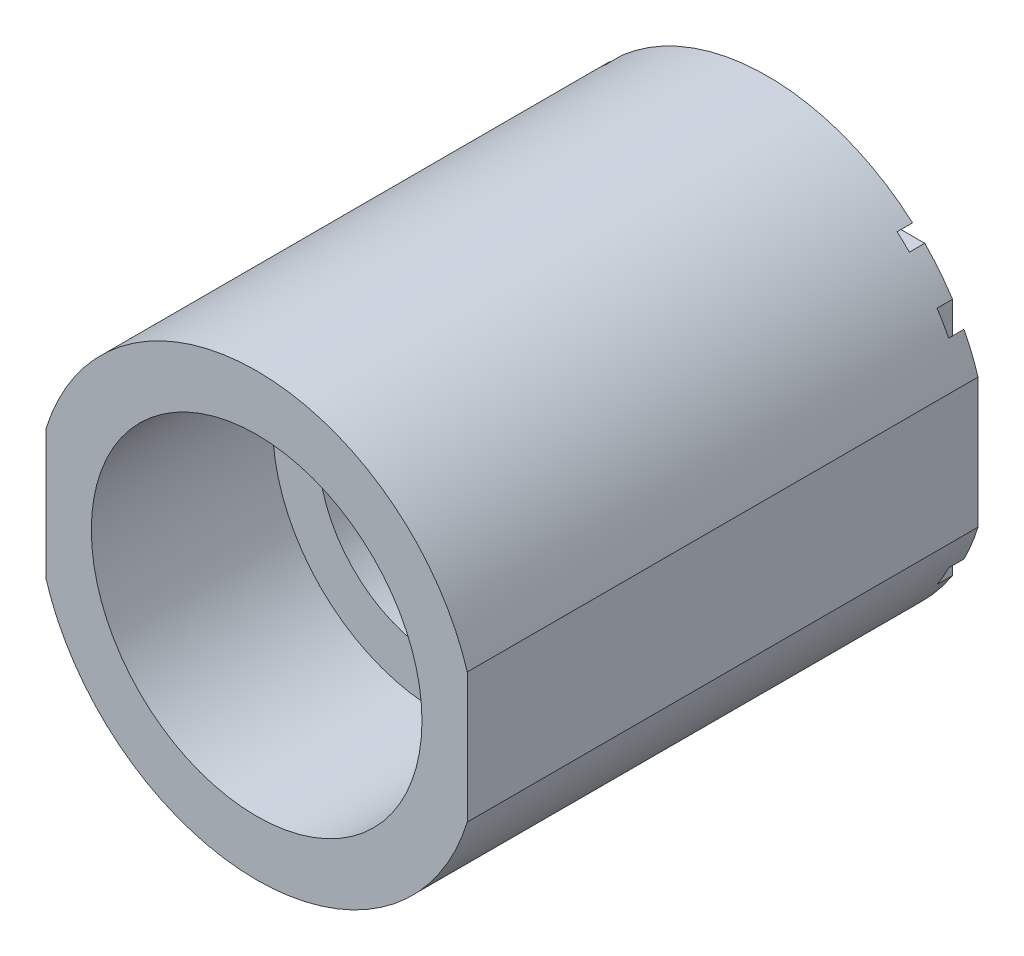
ISO-10303-21;
HEADER;
FILE_DESCRIPTION(('STEP AP214'),'2;1');
FILE_NAME('part.step','',(''),(''),'','','');
FILE_SCHEMA(('AUTOMOTIVE_DESIGN { 1 0 10303 214 1 1 1 1 }'));
ENDSEC;
DATA;
#1=APPLICATION_CONTEXT('core data for automotive mechanical design processes');
#2=APPLICATION_PROTOCOL_DEFINITION('international standard','automotive_design',2000,#1);
#3=PRODUCT_CONTEXT('',#1,'mechanical');
#4=PRODUCT('Part','Part','',(#3));
#5=PRODUCT_RELATED_PRODUCT_CATEGORY('part','',(#4));
#6=PRODUCT_DEFINITION_FORMATION('','',#4);
#7=PRODUCT_DEFINITION_CONTEXT('part definition',#1,'design');
#8=PRODUCT_DEFINITION('design','',#6,#7);
#9=PRODUCT_DEFINITION_SHAPE('','',#8);
#10=(LENGTH_UNIT() NAMED_UNIT(*) SI_UNIT(.MILLI.,.METRE.));
#11=(NAMED_UNIT(*) PLANE_ANGLE_UNIT() SI_UNIT($,.RADIAN.));
#12=(NAMED_UNIT(*) SI_UNIT($,.STERADIAN.) SOLID_ANGLE_UNIT());
#13=UNCERTAINTY_MEASURE_WITH_UNIT(LENGTH_MEASURE(1.E-05),#10,'distance_accuracy_value','');
#14=(GEOMETRIC_REPRESENTATION_CONTEXT(3) GLOBAL_UNCERTAINTY_ASSIGNED_CONTEXT((#13)) GLOBAL_UNIT_ASSIGNED_CONTEXT((#10,
#11,#12)) REPRESENTATION_CONTEXT('',''));
#15=CARTESIAN_POINT('',(0.,0.,0.));
#16=DIRECTION('',(0.,0.,1.));
#17=DIRECTION('',(1.,0.,0.));
#18=AXIS2_PLACEMENT_3D('',#15,#16,#17);
#19=CARTESIAN_POINT('',(0.,0.,0.8));
#20=DIRECTION('',(0.,0.,-1.));
#21=DIRECTION('',(-1.,0.,0.));
#22=AXIS2_PLACEMENT_3D('',#19,#20,#21);
#23=PLANE('',#22);
#24=CARTESIAN_POINT('',(0.,22.475,0.8));
#25=DIRECTION('',(0.,0.,-1.));
#26=DIRECTION('',(-1.,0.,0.));
#27=AXIS2_PLACEMENT_3D('',#24,#25,#26);
#28=CIRCLE('',#27,0.755649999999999);
#29=CARTESIAN_POINT('',(-0.755650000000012,22.475,0.8));
#30=VERTEX_POINT('',#29);
#31=EDGE_CURVE('E161',#30,#30,#28,.T.);
#32=ORIENTED_EDGE('',*,*,#31,.F.);
#33=EDGE_LOOP('',(#32));
#34=FACE_BOUND('',#33,.T.);
#35=DIRECTION('',(1.,0.,0.));
#36=VECTOR('',#35,1.);
#37=CARTESIAN_POINT('',(0.,21.5,0.8));
#38=LINE('',#37,#36);
#39=CARTESIAN_POINT('',(-18.8223437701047,21.5,0.8));
#40=VERTEX_POINT('',#39);
#41=CARTESIAN_POINT('',(18.8223437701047,21.5,0.8));
#42=VERTEX_POINT('',#41);
#43=EDGE_CURVE('E293',#40,#42,#38,.T.);
#44=ORIENTED_EDGE('',*,*,#43,.F.);
#45=CARTESIAN_POINT('',(0.,0.,0.799999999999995));
#46=DIRECTION('',(0.,0.,-1.));
#47=DIRECTION('',(-1.,0.,0.));
#48=AXIS2_PLACEMENT_3D('',#45,#46,#47);
#49=CIRCLE('',#48,28.575);
#50=EDGE_CURVE('E307',#40,#42,#49,.T.);
#51=ORIENTED_EDGE('',*,*,#50,.T.);
#52=EDGE_LOOP('',(#44,#51));
#53=FACE_BOUND('',#52,.T.);
#54=ADVANCED_FACE('F35',(#34,#53),#23,.T.);
#55=DIRECTION('',(0.,1.,0.));
#56=VECTOR('',#55,1.);
#57=CARTESIAN_POINT('',(-25.5,0.,0.8));
#58=LINE('',#57,#56);
#59=CARTESIAN_POINT('',(-25.5,-12.8949844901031,0.8));
#60=VERTEX_POINT('',#59);
#61=CARTESIAN_POINT('',(-25.5,12.8949844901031,0.8));
#62=VERTEX_POINT('',#61);
#63=EDGE_CURVE('E288',#60,#62,#58,.T.);
#64=ORIENTED_EDGE('',*,*,#63,.F.);
#65=CARTESIAN_POINT('',(0.,0.,0.799999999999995));
#66=DIRECTION('',(0.,0.,-1.));
#67=DIRECTION('',(-1.,0.,0.));
#68=AXIS2_PLACEMENT_3D('',#65,#66,#67);
#69=CIRCLE('',#68,28.575);
#70=CARTESIAN_POINT('',(-27.305,-8.42422696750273,0.799999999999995));
#71=VERTEX_POINT('',#70);
#72=EDGE_CURVE('E219',#60,#71,#69,.T.);
#73=ORIENTED_EDGE('',*,*,#72,.T.);
#74=DIRECTION('',(0.,1.,0.));
#75=VECTOR('',#74,1.);
#76=CARTESIAN_POINT('',(-27.305,8.42422696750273,0.8));
#77=LINE('',#76,#75);
#78=CARTESIAN_POINT('',(-27.305,8.42422696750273,0.799999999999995));
#79=VERTEX_POINT('',#78);
#80=EDGE_CURVE('E228',#71,#79,#77,.T.);
#81=ORIENTED_EDGE('',*,*,#80,.T.);
#82=EDGE_CURVE('E225',#79,#62,#49,.T.);
#83=ORIENTED_EDGE('',*,*,#82,.T.);
#84=EDGE_LOOP('',(#64,#73,#81,#83));
#85=FACE_BOUND('',#84,.T.);
#86=ADVANCED_FACE('F322',(#85),#23,.T.);
#87=DIRECTION('',(0.,-1.,0.));
#88=VECTOR('',#87,1.);
#89=CARTESIAN_POINT('',(25.5,0.,0.8));
#90=LINE('',#89,#88);
#91=CARTESIAN_POINT('',(25.5,12.8949844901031,0.8));
#92=VERTEX_POINT('',#91);
#93=CARTESIAN_POINT('',(25.5,-12.8949844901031,0.8));
#94=VERTEX_POINT('',#93);
#95=EDGE_CURVE('E282',#92,#94,#90,.T.);
#96=ORIENTED_EDGE('',*,*,#95,.F.);
#97=CARTESIAN_POINT('',(27.305,8.42422696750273,0.8));
#98=VERTEX_POINT('',#97);
#99=EDGE_CURVE('E223',#92,#98,#49,.T.);
#100=ORIENTED_EDGE('',*,*,#99,.T.);
#101=DIRECTION('',(0.,-1.,0.));
#102=VECTOR('',#101,1.);
#103=CARTESIAN_POINT('',(27.305,8.42422696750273,0.8));
#104=LINE('',#103,#102);
#105=CARTESIAN_POINT('',(27.305,-8.42422696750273,0.8));
#106=VERTEX_POINT('',#105);
#107=EDGE_CURVE('E273',#98,#106,#104,.T.);
#108=ORIENTED_EDGE('',*,*,#107,.T.);
#109=EDGE_CURVE('E220',#106,#94,#69,.T.);
#110=ORIENTED_EDGE('',*,*,#109,.T.);
#111=EDGE_LOOP('',(#96,#100,#108,#110));
#112=FACE_BOUND('',#111,.T.);
#113=ADVANCED_FACE('F330',(#112),#23,.T.);
#114=CARTESIAN_POINT('',(0.,0.,67.));
#115=DIRECTION('',(0.,0.,-1.));
#116=DIRECTION('',(-1.,0.,0.));
#117=AXIS2_PLACEMENT_3D('',#114,#115,#116);
#118=CYLINDRICAL_SURFACE('',#117,28.575);
#119=ORIENTED_EDGE('',*,*,#50,.F.);
#120=DIRECTION('',(0.,0.,-1.));
#121=VECTOR('',#120,1.);
#122=CARTESIAN_POINT('',(-18.8223437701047,21.5,67.));
#123=LINE('',#122,#121);
#124=CARTESIAN_POINT('',(-18.8223437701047,21.5,2.8));
#125=VERTEX_POINT('',#124);
#126=EDGE_CURVE('E175',#40,#125,#123,.F.);
#127=ORIENTED_EDGE('',*,*,#126,.T.);
#128=CARTESIAN_POINT('',(0.,0.,2.8));
#129=DIRECTION('',(0.,0.,-1.));
#130=DIRECTION('',(-1.,0.,0.));
#131=AXIS2_PLACEMENT_3D('',#128,#129,#130);
#132=CIRCLE('',#131,28.575);
#133=CARTESIAN_POINT('',(-20.4090819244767,20.,2.8));
#134=VERTEX_POINT('',#133);
#135=EDGE_CURVE('E11',#134,#125,#132,.T.);
#136=ORIENTED_EDGE('',*,*,#135,.F.);
#137=DIRECTION('',(0.,0.,-1.));
#138=VECTOR('',#137,1.);
#139=CARTESIAN_POINT('',(-20.4090819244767,20.,67.));
#140=LINE('',#139,#138);
#141=CARTESIAN_POINT('',(-20.4090819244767,20.,0.8));
#142=VERTEX_POINT('',#141);
#143=EDGE_CURVE('E172',#134,#142,#140,.T.);
#144=ORIENTED_EDGE('',*,*,#143,.T.);
#145=CARTESIAN_POINT('',(-24.,15.5090497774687,0.799999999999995));
#146=VERTEX_POINT('',#145);
#147=EDGE_CURVE('E229',#146,#142,#49,.T.);
#148=ORIENTED_EDGE('',*,*,#147,.F.);
#149=DIRECTION('',(0.,0.,-1.));
#150=VECTOR('',#149,1.);
#151=CARTESIAN_POINT('',(-24.,15.5090497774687,67.));
#152=LINE('',#151,#150);
#153=CARTESIAN_POINT('',(-24.,15.5090497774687,2.8));
#154=VERTEX_POINT('',#153);
#155=EDGE_CURVE('E58',#146,#154,#152,.F.);
#156=ORIENTED_EDGE('',*,*,#155,.T.);
#157=CARTESIAN_POINT('',(0.,0.,2.8));
#158=DIRECTION('',(0.,0.,-1.));
#159=DIRECTION('',(-1.,0.,0.));
#160=AXIS2_PLACEMENT_3D('',#157,#158,#159);
#161=CIRCLE('',#160,28.575);
#162=CARTESIAN_POINT('',(-25.5,12.8949844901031,2.8));
#163=VERTEX_POINT('',#162);
#164=EDGE_CURVE('E197',#163,#154,#161,.T.);
#165=ORIENTED_EDGE('',*,*,#164,.F.);
#166=DIRECTION('',(0.,0.,-1.));
#167=VECTOR('',#166,1.);
#168=CARTESIAN_POINT('',(-25.5,12.8949844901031,67.));
#169=LINE('',#168,#167);
#170=EDGE_CURVE('E194',#163,#62,#169,.T.);
#171=ORIENTED_EDGE('',*,*,#170,.T.);
#172=ORIENTED_EDGE('',*,*,#82,.F.);
#173=DIRECTION('',(0.,0.,1.));
#174=VECTOR('',#173,1.);
#175=CARTESIAN_POINT('',(-27.305,8.42422696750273,0.));
#176=LINE('',#175,#174);
#177=CARTESIAN_POINT('',(-27.305,8.42422696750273,67.));
#178=VERTEX_POINT('',#177);
#179=EDGE_CURVE('E246',#79,#178,#176,.T.);
#180=ORIENTED_EDGE('',*,*,#179,.T.);
#181=CARTESIAN_POINT('',(0.,0.,67.));
#182=DIRECTION('',(0.,0.,1.));
#183=DIRECTION('',(1.,0.,0.));
#184=AXIS2_PLACEMENT_3D('',#181,#182,#183);
#185=CIRCLE('',#184,28.575);
#186=CARTESIAN_POINT('',(27.305,8.42422696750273,67.));
#187=VERTEX_POINT('',#186);
#188=EDGE_CURVE('E269',#187,#178,#185,.T.);
#189=ORIENTED_EDGE('',*,*,#188,.F.);
#190=DIRECTION('',(0.,0.,1.));
#191=VECTOR('',#190,1.);
#192=CARTESIAN_POINT('',(27.305,8.42422696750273,0.));
#193=LINE('',#192,#191);
#194=EDGE_CURVE('E238',#98,#187,#193,.T.);
#195=ORIENTED_EDGE('',*,*,#194,.F.);
#196=ORIENTED_EDGE('',*,*,#99,.F.);
#197=DIRECTION('',(0.,0.,-1.));
#198=VECTOR('',#197,1.);
#199=CARTESIAN_POINT('',(25.5,12.8949844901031,67.));
#200=LINE('',#199,#198);
#201=CARTESIAN_POINT('',(25.5,12.8949844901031,2.8));
#202=VERTEX_POINT('',#201);
#203=EDGE_CURVE('E214',#92,#202,#200,.F.);
#204=ORIENTED_EDGE('',*,*,#203,.T.);
#205=CARTESIAN_POINT('',(0.,0.,2.8));
#206=DIRECTION('',(0.,0.,-1.));
#207=DIRECTION('',(-1.,0.,0.));
#208=AXIS2_PLACEMENT_3D('',#205,#206,#207);
#209=CIRCLE('',#208,28.575);
#210=CARTESIAN_POINT('',(24.,15.5090497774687,2.8));
#211=VERTEX_POINT('',#210);
#212=EDGE_CURVE('E217',#211,#202,#209,.T.);
#213=ORIENTED_EDGE('',*,*,#212,.F.);
#214=DIRECTION('',(0.,0.,-1.));
#215=VECTOR('',#214,1.);
#216=CARTESIAN_POINT('',(24.,15.5090497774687,67.));
#217=LINE('',#216,#215);
#218=CARTESIAN_POINT('',(24.,15.5090497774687,0.8));
#219=VERTEX_POINT('',#218);
#220=EDGE_CURVE('E208',#211,#219,#217,.T.);
#221=ORIENTED_EDGE('',*,*,#220,.T.);
#222=CARTESIAN_POINT('',(20.4090819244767,20.,0.799999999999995));
#223=VERTEX_POINT('',#222);
#224=EDGE_CURVE('E230',#223,#219,#49,.T.);
#225=ORIENTED_EDGE('',*,*,#224,.F.);
#226=DIRECTION('',(0.,0.,-1.));
#227=VECTOR('',#226,1.);
#228=CARTESIAN_POINT('',(20.4090819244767,20.,67.));
#229=LINE('',#228,#227);
#230=CARTESIAN_POINT('',(20.4090819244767,20.,2.8));
#231=VERTEX_POINT('',#230);
#232=EDGE_CURVE('E50',#223,#231,#229,.F.);
#233=ORIENTED_EDGE('',*,*,#232,.T.);
#234=CARTESIAN_POINT('',(18.8223437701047,21.5,2.8));
#235=VERTEX_POINT('',#234);
#236=EDGE_CURVE('E39',#235,#231,#132,.T.);
#237=ORIENTED_EDGE('',*,*,#236,.F.);
#238=DIRECTION('',(0.,0.,-1.));
#239=VECTOR('',#238,1.);
#240=CARTESIAN_POINT('',(18.8223437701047,21.5,67.));
#241=LINE('',#240,#239);
#242=EDGE_CURVE('E178',#235,#42,#241,.T.);
#243=ORIENTED_EDGE('',*,*,#242,.T.);
#244=EDGE_LOOP('',(#119,#127,#136,#144,#148,#156,#165,#171,#172,#180,#189,#195,#196,#204,#213,
#221,#225,#233,#237,#243));
#245=FACE_BOUND('',#244,.T.);
#246=ADVANCED_FACE('F37',(#245),#118,.T.);
#247=ORIENTED_EDGE('',*,*,#72,.F.);
#248=DIRECTION('',(0.,0.,-1.));
#249=VECTOR('',#248,1.);
#250=CARTESIAN_POINT('',(-25.5,-12.8949844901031,67.));
#251=LINE('',#250,#249);
#252=CARTESIAN_POINT('',(-25.5,-12.8949844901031,2.8));
#253=VERTEX_POINT('',#252);
#254=EDGE_CURVE('E191',#60,#253,#251,.F.);
#255=ORIENTED_EDGE('',*,*,#254,.T.);
#256=CARTESIAN_POINT('',(0.,0.,2.8));
#257=DIRECTION('',(0.,0.,-1.));
#258=DIRECTION('',(-1.,0.,0.));
#259=AXIS2_PLACEMENT_3D('',#256,#257,#258);
#260=CIRCLE('',#259,28.575);
#261=CARTESIAN_POINT('',(-24.,-15.5090497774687,2.8));
#262=VERTEX_POINT('',#261);
#263=EDGE_CURVE('E290',#262,#253,#260,.T.);
#264=ORIENTED_EDGE('',*,*,#263,.F.);
#265=DIRECTION('',(0.,0.,-1.));
#266=VECTOR('',#265,1.);
#267=CARTESIAN_POINT('',(-24.,-15.5090497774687,67.));
#268=LINE('',#267,#266);
#269=CARTESIAN_POINT('',(-24.,-15.5090497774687,0.8));
#270=VERTEX_POINT('',#269);
#271=EDGE_CURVE('E187',#262,#270,#268,.T.);
#272=ORIENTED_EDGE('',*,*,#271,.T.);
#273=CARTESIAN_POINT('',(24.,-15.5090497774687,0.799999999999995));
#274=VERTEX_POINT('',#273);
#275=EDGE_CURVE('E224',#274,#270,#69,.T.);
#276=ORIENTED_EDGE('',*,*,#275,.F.);
#277=DIRECTION('',(0.,0.,-1.));
#278=VECTOR('',#277,1.);
#279=CARTESIAN_POINT('',(24.,-15.5090497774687,67.));
#280=LINE('',#279,#278);
#281=CARTESIAN_POINT('',(24.,-15.5090497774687,2.8));
#282=VERTEX_POINT('',#281);
#283=EDGE_CURVE('E205',#274,#282,#280,.F.);
#284=ORIENTED_EDGE('',*,*,#283,.T.);
#285=CARTESIAN_POINT('',(0.,0.,2.8));
#286=DIRECTION('',(0.,0.,-1.));
#287=DIRECTION('',(-1.,0.,0.));
#288=AXIS2_PLACEMENT_3D('',#285,#286,#287);
#289=CIRCLE('',#288,28.575);
#290=CARTESIAN_POINT('',(25.5,-12.8949844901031,2.8));
#291=VERTEX_POINT('',#290);
#292=EDGE_CURVE('E284',#291,#282,#289,.T.);
#293=ORIENTED_EDGE('',*,*,#292,.F.);
#294=DIRECTION('',(0.,0.,-1.));
#295=VECTOR('',#294,1.);
#296=CARTESIAN_POINT('',(25.5,-12.8949844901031,67.));
#297=LINE('',#296,#295);
#298=EDGE_CURVE('E211',#291,#94,#297,.T.);
#299=ORIENTED_EDGE('',*,*,#298,.T.);
#300=ORIENTED_EDGE('',*,*,#109,.F.);
#301=DIRECTION('',(0.,0.,1.));
#302=VECTOR('',#301,1.);
#303=CARTESIAN_POINT('',(27.305,-8.42422696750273,0.));
#304=LINE('',#303,#302);
#305=CARTESIAN_POINT('',(27.305,-8.42422696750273,67.));
#306=VERTEX_POINT('',#305);
#307=EDGE_CURVE('E239',#106,#306,#304,.T.);
#308=ORIENTED_EDGE('',*,*,#307,.T.);
#309=CARTESIAN_POINT('',(-27.305,-8.42422696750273,67.));
#310=VERTEX_POINT('',#309);
#311=EDGE_CURVE('E270',#310,#306,#185,.T.);
#312=ORIENTED_EDGE('',*,*,#311,.F.);
#313=DIRECTION('',(0.,0.,1.));
#314=VECTOR('',#313,1.);
#315=CARTESIAN_POINT('',(-27.305,-8.42422696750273,0.));
#316=LINE('',#315,#314);
#317=EDGE_CURVE('E245',#71,#310,#316,.T.);
#318=ORIENTED_EDGE('',*,*,#317,.F.);
#319=EDGE_LOOP('',(#247,#255,#264,#272,#276,#284,#293,#299,#300,#308,#312,#318));
#320=FACE_BOUND('',#319,.T.);
#321=ADVANCED_FACE('F352',(#320),#118,.T.);
#322=CARTESIAN_POINT('',(0.,0.,64.));
#323=DIRECTION('',(0.,0.,1.));
#324=DIRECTION('',(1.,0.,0.));
#325=AXIS2_PLACEMENT_3D('',#322,#323,#324);
#326=CYLINDRICAL_SURFACE('',#325,15.39494);
#327=CARTESIAN_POINT('',(0.,0.,6.8));
#328=DIRECTION('',(0.,0.,1.));
#329=DIRECTION('',(1.,0.,0.));
#330=AXIS2_PLACEMENT_3D('',#327,#328,#329);
#331=CIRCLE('',#330,15.39494);
#332=CARTESIAN_POINT('',(15.39494,0.,6.8));
#333=VERTEX_POINT('',#332);
#334=EDGE_CURVE('E248',#333,#333,#331,.T.);
#335=ORIENTED_EDGE('',*,*,#334,.T.);
#336=EDGE_LOOP('',(#335));
#337=FACE_BOUND('',#336,.T.);
#338=CARTESIAN_POINT('',(0.,0.,0.799999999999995));
#339=DIRECTION('',(0.,0.,-1.));
#340=DIRECTION('',(-1.,0.,0.));
#341=AXIS2_PLACEMENT_3D('',#338,#339,#340);
#342=CIRCLE('',#341,15.39494);
#343=CARTESIAN_POINT('',(-15.39494,0.,0.799999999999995));
#344=VERTEX_POINT('',#343);
#345=EDGE_CURVE('E232',#344,#344,#342,.T.);
#346=ORIENTED_EDGE('',*,*,#345,.T.);
#347=EDGE_LOOP('',(#346));
#348=FACE_BOUND('',#347,.T.);
#349=ADVANCED_FACE('F507',(#337,#348),#326,.F.);
#350=CARTESIAN_POINT('',(-27.305,8.42422696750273,0.));
#351=DIRECTION('',(1.,0.,0.));
#352=DIRECTION('',(0.,0.,-1.));
#353=AXIS2_PLACEMENT_3D('',#350,#351,#352);
#354=PLANE('',#353);
#355=ORIENTED_EDGE('',*,*,#80,.F.);
#356=ORIENTED_EDGE('',*,*,#317,.T.);
#357=DIRECTION('',(0.,1.,0.));
#358=VECTOR('',#357,1.);
#359=CARTESIAN_POINT('',(-27.305,8.42422696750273,67.));
#360=LINE('',#359,#358);
#361=EDGE_CURVE('E241',#310,#178,#360,.T.);
#362=ORIENTED_EDGE('',*,*,#361,.T.);
#363=ORIENTED_EDGE('',*,*,#179,.F.);
#364=EDGE_LOOP('',(#355,#356,#362,#363));
#365=FACE_BOUND('',#364,.T.);
#366=ADVANCED_FACE('F382',(#365),#354,.F.);
#367=CARTESIAN_POINT('',(27.305,8.42422696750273,0.));
#368=DIRECTION('',(-1.,0.,0.));
#369=DIRECTION('',(0.,0.,1.));
#370=AXIS2_PLACEMENT_3D('',#367,#368,#369);
#371=PLANE('',#370);
#372=ORIENTED_EDGE('',*,*,#107,.F.);
#373=ORIENTED_EDGE('',*,*,#194,.T.);
#374=DIRECTION('',(0.,-1.,0.));
#375=VECTOR('',#374,1.);
#376=CARTESIAN_POINT('',(27.305,8.42422696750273,67.));
#377=LINE('',#376,#375);
#378=EDGE_CURVE('E235',#187,#306,#377,.T.);
#379=ORIENTED_EDGE('',*,*,#378,.T.);
#380=ORIENTED_EDGE('',*,*,#307,.F.);
#381=EDGE_LOOP('',(#372,#373,#379,#380));
#382=FACE_BOUND('',#381,.T.);
#383=ADVANCED_FACE('F360',(#382),#371,.F.);
#384=CARTESIAN_POINT('',(0.,0.,67.001));
#385=DIRECTION('',(0.,0.,-1.));
#386=DIRECTION('',(-1.,0.,0.));
#387=AXIS2_PLACEMENT_3D('',#384,#385,#386);
#388=CYLINDRICAL_SURFACE('',#387,7.5);
#389=CARTESIAN_POINT('',(0.,0.,10.));
#390=DIRECTION('',(0.,0.,1.));
#391=DIRECTION('',(1.,0.,0.));
#392=AXIS2_PLACEMENT_3D('',#389,#390,#391);
#393=CIRCLE('',#392,7.5);
#394=CARTESIAN_POINT('',(7.5,0.,10.));
#395=VERTEX_POINT('',#394);
#396=EDGE_CURVE('E256',#395,#395,#393,.F.);
#397=ORIENTED_EDGE('',*,*,#396,.F.);
#398=EDGE_LOOP('',(#397));
#399=FACE_BOUND('',#398,.T.);
#400=CARTESIAN_POINT('',(0.,0.,7.4523765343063));
#401=DIRECTION('',(0.,0.,-1.));
#402=DIRECTION('',(-1.,0.,0.));
#403=AXIS2_PLACEMENT_3D('',#400,#401,#402);
#404=CIRCLE('',#403,7.5);
#405=CARTESIAN_POINT('',(-7.49999999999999,0.,7.4523765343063));
#406=VERTEX_POINT('',#405);
#407=EDGE_CURVE('E255',#406,#406,#404,.F.);
#408=ORIENTED_EDGE('',*,*,#407,.F.);
#409=EDGE_LOOP('',(#408));
#410=FACE_BOUND('',#409,.T.);
#411=ADVANCED_FACE('F535',(#399,#410),#388,.F.);
#412=CARTESIAN_POINT('',(0.,0.,67.));
#413=DIRECTION('',(0.,0.,1.));
#414=DIRECTION('',(1.,0.,0.));
#415=AXIS2_PLACEMENT_3D('',#412,#413,#414);
#416=PLANE('',#415);
#417=ORIENTED_EDGE('',*,*,#378,.F.);
#418=ORIENTED_EDGE('',*,*,#188,.T.);
#419=ORIENTED_EDGE('',*,*,#361,.F.);
#420=ORIENTED_EDGE('',*,*,#311,.T.);
#421=EDGE_LOOP('',(#417,#418,#419,#420));
#422=FACE_BOUND('',#421,.T.);
#423=CARTESIAN_POINT('',(0.,0.,67.));
#424=DIRECTION('',(0.,0.,1.));
#425=DIRECTION('',(1.,0.,0.));
#426=AXIS2_PLACEMENT_3D('',#423,#424,#425);
#427=CIRCLE('',#426,21.43125);
#428=CARTESIAN_POINT('',(21.43125,0.,67.));
#429=VERTEX_POINT('',#428);
#430=EDGE_CURVE('E259',#429,#429,#427,.T.);
#431=ORIENTED_EDGE('',*,*,#430,.F.);
#432=EDGE_LOOP('',(#431));
#433=FACE_BOUND('',#432,.T.);
#434=ADVANCED_FACE('F363',(#422,#433),#416,.T.);
#435=CARTESIAN_POINT('',(0.,0.,43.5));
#436=DIRECTION('',(0.,0.,1.));
#437=DIRECTION('',(1.,0.,0.));
#438=AXIS2_PLACEMENT_3D('',#435,#436,#437);
#439=PLANE('',#438);
#440=CARTESIAN_POINT('',(0.,0.,43.5));
#441=DIRECTION('',(0.,0.,1.));
#442=DIRECTION('',(1.,0.,0.));
#443=AXIS2_PLACEMENT_3D('',#440,#441,#442);
#444=CIRCLE('',#443,21.43125);
#445=CARTESIAN_POINT('',(21.43125,0.,43.5));
#446=VERTEX_POINT('',#445);
#447=EDGE_CURVE('E260',#446,#446,#444,.T.);
#448=ORIENTED_EDGE('',*,*,#447,.T.);
#449=EDGE_LOOP('',(#448));
#450=FACE_BOUND('',#449,.T.);
#451=CARTESIAN_POINT('',(0.,0.,43.5));
#452=DIRECTION('',(0.,0.,1.));
#453=DIRECTION('',(1.,0.,0.));
#454=AXIS2_PLACEMENT_3D('',#451,#452,#453);
#455=CIRCLE('',#454,15.478125);
#456=CARTESIAN_POINT('',(15.478125,0.,43.5));
#457=VERTEX_POINT('',#456);
#458=EDGE_CURVE('E263',#457,#457,#455,.F.);
#459=ORIENTED_EDGE('',*,*,#458,.T.);
#460=EDGE_LOOP('',(#459));
#461=FACE_BOUND('',#460,.T.);
#462=ADVANCED_FACE('F547',(#450,#461),#439,.T.);
#463=CARTESIAN_POINT('',(0.,0.,43.5));
#464=DIRECTION('',(0.,0.,1.));
#465=DIRECTION('',(1.,0.,0.));
#466=AXIS2_PLACEMENT_3D('',#463,#464,#465);
#467=CYLINDRICAL_SURFACE('',#466,21.43125);
#468=ORIENTED_EDGE('',*,*,#447,.F.);
#469=EDGE_LOOP('',(#468));
#470=FACE_BOUND('',#469,.T.);
#471=ORIENTED_EDGE('',*,*,#430,.T.);
#472=EDGE_LOOP('',(#471));
#473=FACE_BOUND('',#472,.T.);
#474=ADVANCED_FACE('F554',(#470,#473),#467,.F.);
#475=CARTESIAN_POINT('',(0.,0.,10.));
#476=DIRECTION('',(0.,0.,1.));
#477=DIRECTION('',(1.,0.,0.));
#478=AXIS2_PLACEMENT_3D('',#475,#476,#477);
#479=PLANE('',#478);
#480=ORIENTED_EDGE('',*,*,#396,.T.);
#481=EDGE_LOOP('',(#480));
#482=FACE_BOUND('',#481,.T.);
#483=CARTESIAN_POINT('',(0.,0.,10.));
#484=DIRECTION('',(0.,0.,1.));
#485=DIRECTION('',(1.,0.,0.));
#486=AXIS2_PLACEMENT_3D('',#483,#484,#485);
#487=CIRCLE('',#486,15.478125);
#488=CARTESIAN_POINT('',(15.478125,0.,10.));
#489=VERTEX_POINT('',#488);
#490=EDGE_CURVE('E266',#489,#489,#487,.T.);
#491=ORIENTED_EDGE('',*,*,#490,.T.);
#492=EDGE_LOOP('',(#491));
#493=FACE_BOUND('',#492,.T.);
#494=ADVANCED_FACE('F562',(#482,#493),#479,.T.);
#495=CARTESIAN_POINT('',(0.,0.,10.));
#496=DIRECTION('',(0.,0.,1.));
#497=DIRECTION('',(1.,0.,0.));
#498=AXIS2_PLACEMENT_3D('',#495,#496,#497);
#499=CYLINDRICAL_SURFACE('',#498,15.478125);
#500=CARTESIAN_POINT('',(15.478125,0.,10.));
#501=CARTESIAN_POINT('',(15.478125,0.,10.3489583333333));
#502=CARTESIAN_POINT('',(15.478125,0.,10.6979166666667));
#503=CARTESIAN_POINT('',(15.478125,0.,11.3958333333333));
#504=CARTESIAN_POINT('',(15.478125,0.,11.7447916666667));
#505=CARTESIAN_POINT('',(15.478125,0.,12.4427083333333));
#506=CARTESIAN_POINT('',(15.478125,0.,12.7916666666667));
#507=CARTESIAN_POINT('',(15.478125,0.,13.4895833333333));
#508=CARTESIAN_POINT('',(15.478125,0.,13.8385416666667));
#509=CARTESIAN_POINT('',(15.478125,0.,14.5364583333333));
#510=CARTESIAN_POINT('',(15.478125,0.,14.8854166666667));
#511=CARTESIAN_POINT('',(15.478125,0.,15.5833333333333));
#512=CARTESIAN_POINT('',(15.478125,0.,15.9322916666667));
#513=CARTESIAN_POINT('',(15.478125,0.,16.6302083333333));
#514=CARTESIAN_POINT('',(15.478125,0.,16.9791666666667));
#515=CARTESIAN_POINT('',(15.478125,0.,17.6770833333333));
#516=CARTESIAN_POINT('',(15.478125,0.,18.0260416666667));
#517=CARTESIAN_POINT('',(15.478125,0.,18.7239583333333));
#518=CARTESIAN_POINT('',(15.478125,0.,19.0729166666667));
#519=CARTESIAN_POINT('',(15.478125,0.,19.7708333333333));
#520=CARTESIAN_POINT('',(15.478125,0.,20.1197916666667));
#521=CARTESIAN_POINT('',(15.478125,0.,20.8177083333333));
#522=CARTESIAN_POINT('',(15.478125,0.,21.1666666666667));
#523=CARTESIAN_POINT('',(15.478125,0.,21.8645833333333));
#524=CARTESIAN_POINT('',(15.478125,0.,22.2135416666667));
#525=CARTESIAN_POINT('',(15.478125,0.,22.9114583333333));
#526=CARTESIAN_POINT('',(15.478125,0.,23.2604166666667));
#527=CARTESIAN_POINT('',(15.478125,0.,23.9583333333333));
#528=CARTESIAN_POINT('',(15.478125,0.,24.3072916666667));
#529=CARTESIAN_POINT('',(15.478125,0.,25.0052083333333));
#530=CARTESIAN_POINT('',(15.478125,0.,25.3541666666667));
#531=CARTESIAN_POINT('',(15.478125,0.,26.0520833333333));
#532=CARTESIAN_POINT('',(15.478125,0.,26.4010416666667));
#533=CARTESIAN_POINT('',(15.478125,0.,27.0989583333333));
#534=CARTESIAN_POINT('',(15.478125,0.,27.4479166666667));
#535=CARTESIAN_POINT('',(15.478125,0.,28.1458333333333));
#536=CARTESIAN_POINT('',(15.478125,0.,28.4947916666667));
#537=CARTESIAN_POINT('',(15.478125,0.,29.1927083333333));
#538=CARTESIAN_POINT('',(15.478125,0.,29.5416666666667));
#539=CARTESIAN_POINT('',(15.478125,0.,30.2395833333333));
#540=CARTESIAN_POINT('',(15.478125,0.,30.5885416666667));
#541=CARTESIAN_POINT('',(15.478125,0.,31.2864583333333));
#542=CARTESIAN_POINT('',(15.478125,0.,31.6354166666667));
#543=CARTESIAN_POINT('',(15.478125,0.,32.3333333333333));
#544=CARTESIAN_POINT('',(15.478125,0.,32.6822916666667));
#545=CARTESIAN_POINT('',(15.478125,0.,33.3802083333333));
#546=CARTESIAN_POINT('',(15.478125,0.,33.7291666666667));
#547=CARTESIAN_POINT('',(15.478125,0.,34.4270833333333));
#548=CARTESIAN_POINT('',(15.478125,0.,34.7760416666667));
#549=CARTESIAN_POINT('',(15.478125,0.,35.4739583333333));
#550=CARTESIAN_POINT('',(15.478125,0.,35.8229166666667));
#551=CARTESIAN_POINT('',(15.478125,0.,36.5208333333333));
#552=CARTESIAN_POINT('',(15.478125,0.,36.8697916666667));
#553=CARTESIAN_POINT('',(15.478125,0.,37.5677083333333));
#554=CARTESIAN_POINT('',(15.478125,0.,37.9166666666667));
#555=CARTESIAN_POINT('',(15.478125,0.,38.6145833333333));
#556=CARTESIAN_POINT('',(15.478125,0.,38.9635416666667));
#557=CARTESIAN_POINT('',(15.478125,0.,39.6614583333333));
#558=CARTESIAN_POINT('',(15.478125,0.,40.0104166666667));
#559=CARTESIAN_POINT('',(15.478125,0.,40.7083333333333));
#560=CARTESIAN_POINT('',(15.478125,0.,41.0572916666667));
#561=CARTESIAN_POINT('',(15.478125,0.,41.7552083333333));
#562=CARTESIAN_POINT('',(15.478125,0.,42.1041666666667));
#563=CARTESIAN_POINT('',(15.478125,0.,42.8020833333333));
#564=CARTESIAN_POINT('',(15.478125,0.,43.1510416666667));
#565=CARTESIAN_POINT('',(15.478125,0.,43.5));
#566=B_SPLINE_CURVE_WITH_KNOTS('',3,(#500,#501,#502,#503,#504,#505,#506,#507,#508,#509,#510,
#511,#512,#513,#514,#515,#516,#517,#518,#519,#520,#521,#522,#523,#524,#525,#526,#527,#528,#529,
#530,#531,#532,#533,#534,#535,#536,#537,#538,#539,#540,#541,#542,#543,#544,#545,#546,#547,#548,
#549,#550,#551,#552,#553,#554,#555,#556,#557,#558,#559,#560,#561,#562,#563,#564,#565),
.UNSPECIFIED.,.F.,.F.,(4,2,2,2,2,2,2,2,2,2,2,2,2,2,2,2,2,2,2,2,2,2,2,2,2,2,2,2,2,2,2,2,4),(0.,
1.046875,2.09375,3.140625,4.1875,5.234375,6.28125,7.328125,8.375,9.421875,10.46875,11.515625,
12.5625,13.609375,14.65625,15.703125,16.75,17.796875,18.84375,19.890625,20.9375,21.984375,
23.03125,24.078125,25.125,26.171875,27.21875,28.265625,29.3125,30.359375,31.40625,32.453125,
33.5),.UNSPECIFIED.);
#567=EDGE_CURVE('BSEAM570',#489,#457,#566,.T.);
#568=ORIENTED_EDGE('',*,*,#490,.F.);
#569=ORIENTED_EDGE('',*,*,#458,.F.);
#570=ORIENTED_EDGE('',*,*,#567,.T.);
#571=ORIENTED_EDGE('',*,*,#567,.F.);
#572=EDGE_LOOP('',(#568,#570,#569,#571));
#573=FACE_BOUND('',#572,.T.);
#574=ADVANCED_FACE('F570',(#573),#499,.F.);
#575=CARTESIAN_POINT('',(0.,0.,6.8));
#576=DIRECTION('',(0.,0.,-1.));
#577=DIRECTION('',(-1.,0.,0.));
#578=AXIS2_PLACEMENT_3D('',#575,#576,#577);
#579=CONICAL_SURFACE('',#578,8.20546025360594,0.8244725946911);
#580=CARTESIAN_POINT('',(0.,0.,6.8));
#581=DIRECTION('',(0.,0.,1.));
#582=DIRECTION('',(1.,0.,0.));
#583=AXIS2_PLACEMENT_3D('',#580,#581,#582);
#584=CIRCLE('',#583,8.20546025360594);
#585=CARTESIAN_POINT('',(8.20546025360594,0.,6.8));
#586=VERTEX_POINT('',#585);
#587=EDGE_CURVE('E252',#586,#586,#584,.T.);
#588=ORIENTED_EDGE('',*,*,#587,.F.);
#589=EDGE_LOOP('',(#588));
#590=FACE_BOUND('',#589,.T.);
#591=ORIENTED_EDGE('',*,*,#407,.T.);
#592=EDGE_LOOP('',(#591));
#593=FACE_BOUND('',#592,.T.);
#594=ADVANCED_FACE('F345',(#590,#593),#579,.F.);
#595=CARTESIAN_POINT('',(-8.20546025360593,0.,6.8));
#596=DIRECTION('',(0.,0.,-1.));
#597=DIRECTION('',(-1.,0.,0.));
#598=AXIS2_PLACEMENT_3D('',#595,#596,#597);
#599=PLANE('',#598);
#600=ORIENTED_EDGE('',*,*,#587,.T.);
#601=EDGE_LOOP('',(#600));
#602=FACE_BOUND('',#601,.T.);
#603=ORIENTED_EDGE('',*,*,#334,.F.);
#604=EDGE_LOOP('',(#603));
#605=FACE_BOUND('',#604,.T.);
#606=ADVANCED_FACE('F337',(#602,#605),#599,.T.);
#607=DIRECTION('',(-1.,0.,0.));
#608=VECTOR('',#607,1.);
#609=CARTESIAN_POINT('',(0.,20.,0.8));
#610=LINE('',#609,#608);
#611=EDGE_CURVE('E292',#223,#142,#610,.T.);
#612=ORIENTED_EDGE('',*,*,#611,.F.);
#613=ORIENTED_EDGE('',*,*,#224,.T.);
#614=DIRECTION('',(0.,1.,0.));
#615=VECTOR('',#614,1.);
#616=CARTESIAN_POINT('',(24.,0.,0.8));
#617=LINE('',#616,#615);
#618=EDGE_CURVE('E279',#274,#219,#617,.T.);
#619=ORIENTED_EDGE('',*,*,#618,.F.);
#620=ORIENTED_EDGE('',*,*,#275,.T.);
#621=DIRECTION('',(0.,-1.,0.));
#622=VECTOR('',#621,1.);
#623=CARTESIAN_POINT('',(-24.,0.,0.8));
#624=LINE('',#623,#622);
#625=EDGE_CURVE('E286',#146,#270,#624,.T.);
#626=ORIENTED_EDGE('',*,*,#625,.F.);
#627=ORIENTED_EDGE('',*,*,#147,.T.);
#628=EDGE_LOOP('',(#612,#613,#619,#620,#626,#627));
#629=FACE_BOUND('',#628,.T.);
#630=ORIENTED_EDGE('',*,*,#345,.F.);
#631=EDGE_LOOP('',(#630));
#632=FACE_BOUND('',#631,.T.);
#633=ADVANCED_FACE('F315',(#629,#632),#23,.T.);
#634=CARTESIAN_POINT('',(0.,0.,2.8));
#635=DIRECTION('',(0.,0.,-1.));
#636=DIRECTION('',(-1.,0.,0.));
#637=AXIS2_PLACEMENT_3D('',#634,#635,#636);
#638=PLANE('',#637);
#639=ORIENTED_EDGE('',*,*,#212,.T.);
#640=DIRECTION('',(0.,-1.,0.));
#641=VECTOR('',#640,1.);
#642=CARTESIAN_POINT('',(25.5,28.575,2.8));
#643=LINE('',#642,#641);
#644=EDGE_CURVE('E199',#202,#291,#643,.T.);
#645=ORIENTED_EDGE('',*,*,#644,.T.);
#646=ORIENTED_EDGE('',*,*,#292,.T.);
#647=DIRECTION('',(0.,1.,0.));
#648=VECTOR('',#647,1.);
#649=CARTESIAN_POINT('',(24.,28.575,2.8));
#650=LINE('',#649,#648);
#651=EDGE_CURVE('E202',#282,#211,#650,.T.);
#652=ORIENTED_EDGE('',*,*,#651,.T.);
#653=EDGE_LOOP('',(#639,#645,#646,#652));
#654=FACE_BOUND('',#653,.T.);
#655=ADVANCED_FACE('F336',(#654),#638,.T.);
#656=CARTESIAN_POINT('',(25.5,28.575,2.8));
#657=DIRECTION('',(1.,0.,0.));
#658=DIRECTION('',(0.,0.,-1.));
#659=AXIS2_PLACEMENT_3D('',#656,#657,#658);
#660=PLANE('',#659);
#661=ORIENTED_EDGE('',*,*,#95,.T.);
#662=ORIENTED_EDGE('',*,*,#298,.F.);
#663=ORIENTED_EDGE('',*,*,#644,.F.);
#664=ORIENTED_EDGE('',*,*,#203,.F.);
#665=EDGE_LOOP('',(#661,#662,#663,#664));
#666=FACE_BOUND('',#665,.T.);
#667=ADVANCED_FACE('F342',(#666),#660,.F.);
#668=CARTESIAN_POINT('',(24.,28.575,2.8));
#669=DIRECTION('',(-1.,0.,0.));
#670=DIRECTION('',(0.,0.,1.));
#671=AXIS2_PLACEMENT_3D('',#668,#669,#670);
#672=PLANE('',#671);
#673=ORIENTED_EDGE('',*,*,#651,.F.);
#674=ORIENTED_EDGE('',*,*,#283,.F.);
#675=ORIENTED_EDGE('',*,*,#618,.T.);
#676=ORIENTED_EDGE('',*,*,#220,.F.);
#677=EDGE_LOOP('',(#673,#674,#675,#676));
#678=FACE_BOUND('',#677,.T.);
#679=ADVANCED_FACE('F374',(#678),#672,.F.);
#680=CARTESIAN_POINT('',(0.,0.,2.8));
#681=DIRECTION('',(0.,0.,-1.));
#682=DIRECTION('',(-1.,0.,0.));
#683=AXIS2_PLACEMENT_3D('',#680,#681,#682);
#684=PLANE('',#683);
#685=ORIENTED_EDGE('',*,*,#164,.T.);
#686=DIRECTION('',(0.,-1.,0.));
#687=VECTOR('',#686,1.);
#688=CARTESIAN_POINT('',(-24.,28.575,2.8));
#689=LINE('',#688,#687);
#690=EDGE_CURVE('E181',#154,#262,#689,.T.);
#691=ORIENTED_EDGE('',*,*,#690,.T.);
#692=ORIENTED_EDGE('',*,*,#263,.T.);
#693=DIRECTION('',(0.,1.,0.));
#694=VECTOR('',#693,1.);
#695=CARTESIAN_POINT('',(-25.5,28.575,2.8));
#696=LINE('',#695,#694);
#697=EDGE_CURVE('E184',#253,#163,#696,.T.);
#698=ORIENTED_EDGE('',*,*,#697,.T.);
#699=EDGE_LOOP('',(#685,#691,#692,#698));
#700=FACE_BOUND('',#699,.T.);
#701=ADVANCED_FACE('F387',(#700),#684,.T.);
#702=CARTESIAN_POINT('',(-25.5,28.575,2.8));
#703=DIRECTION('',(-1.,0.,0.));
#704=DIRECTION('',(0.,0.,1.));
#705=AXIS2_PLACEMENT_3D('',#702,#703,#704);
#706=PLANE('',#705);
#707=ORIENTED_EDGE('',*,*,#697,.F.);
#708=ORIENTED_EDGE('',*,*,#254,.F.);
#709=ORIENTED_EDGE('',*,*,#63,.T.);
#710=ORIENTED_EDGE('',*,*,#170,.F.);
#711=EDGE_LOOP('',(#707,#708,#709,#710));
#712=FACE_BOUND('',#711,.T.);
#713=ADVANCED_FACE('F385',(#712),#706,.F.);
#714=CARTESIAN_POINT('',(-24.,28.575,2.8));
#715=DIRECTION('',(1.,0.,0.));
#716=DIRECTION('',(0.,0.,-1.));
#717=AXIS2_PLACEMENT_3D('',#714,#715,#716);
#718=PLANE('',#717);
#719=ORIENTED_EDGE('',*,*,#625,.T.);
#720=ORIENTED_EDGE('',*,*,#271,.F.);
#721=ORIENTED_EDGE('',*,*,#690,.F.);
#722=ORIENTED_EDGE('',*,*,#155,.F.);
#723=EDGE_LOOP('',(#719,#720,#721,#722));
#724=FACE_BOUND('',#723,.T.);
#725=ADVANCED_FACE('F388',(#724),#718,.F.);
#726=CARTESIAN_POINT('',(0.,0.,2.8));
#727=DIRECTION('',(0.,0.,-1.));
#728=DIRECTION('',(-1.,0.,0.));
#729=AXIS2_PLACEMENT_3D('',#726,#727,#728);
#730=PLANE('',#729);
#731=ORIENTED_EDGE('',*,*,#135,.T.);
#732=DIRECTION('',(1.,0.,0.));
#733=VECTOR('',#732,1.);
#734=CARTESIAN_POINT('',(25.5,21.5,2.8));
#735=LINE('',#734,#733);
#736=EDGE_CURVE('E164',#125,#235,#735,.T.);
#737=ORIENTED_EDGE('',*,*,#736,.T.);
#738=ORIENTED_EDGE('',*,*,#236,.T.);
#739=DIRECTION('',(-1.,0.,0.));
#740=VECTOR('',#739,1.);
#741=CARTESIAN_POINT('',(25.5,20.,2.8));
#742=LINE('',#741,#740);
#743=EDGE_CURVE('E160',#231,#134,#742,.T.);
#744=ORIENTED_EDGE('',*,*,#743,.T.);
#745=EDGE_LOOP('',(#731,#737,#738,#744));
#746=FACE_BOUND('',#745,.T.);
#747=ADVANCED_FACE('F298',(#746),#730,.T.);
#748=CARTESIAN_POINT('',(25.5,21.5,2.8));
#749=DIRECTION('',(0.,1.,0.));
#750=DIRECTION('',(0.,0.,1.));
#751=AXIS2_PLACEMENT_3D('',#748,#749,#750);
#752=PLANE('',#751);
#753=ORIENTED_EDGE('',*,*,#736,.F.);
#754=ORIENTED_EDGE('',*,*,#126,.F.);
#755=ORIENTED_EDGE('',*,*,#43,.T.);
#756=ORIENTED_EDGE('',*,*,#242,.F.);
#757=EDGE_LOOP('',(#753,#754,#755,#756));
#758=FACE_BOUND('',#757,.T.);
#759=ADVANCED_FACE('F319',(#758),#752,.F.);
#760=CARTESIAN_POINT('',(25.5,20.,2.8));
#761=DIRECTION('',(0.,-1.,0.));
#762=DIRECTION('',(0.,0.,-1.));
#763=AXIS2_PLACEMENT_3D('',#760,#761,#762);
#764=PLANE('',#763);
#765=ORIENTED_EDGE('',*,*,#743,.F.);
#766=ORIENTED_EDGE('',*,*,#232,.F.);
#767=ORIENTED_EDGE('',*,*,#611,.T.);
#768=ORIENTED_EDGE('',*,*,#143,.F.);
#769=EDGE_LOOP('',(#765,#766,#767,#768));
#770=FACE_BOUND('',#769,.T.);
#771=ADVANCED_FACE('F154',(#770),#764,.F.);
#772=CARTESIAN_POINT('',(0.,22.475,5.7));
#773=DIRECTION('',(0.,0.,-1.));
#774=DIRECTION('',(-1.,0.,0.));
#775=AXIS2_PLACEMENT_3D('',#772,#773,#774);
#776=CONICAL_SURFACE('',#775,0.755649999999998,1.02974425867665);
#777=CARTESIAN_POINT('',(0.,22.475,6.15404032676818));
#778=VERTEX_POINT('',#777);
#779=VERTEX_LOOP('',#778);
#780=FACE_BOUND('',#779,.T.);
#781=CARTESIAN_POINT('',(0.,22.475,5.7));
#782=DIRECTION('',(0.,0.,-1.));
#783=DIRECTION('',(-1.,0.,0.));
#784=AXIS2_PLACEMENT_3D('',#781,#782,#783);
#785=CIRCLE('',#784,0.755649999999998);
#786=CARTESIAN_POINT('',(-0.755650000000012,22.475,5.7));
#787=VERTEX_POINT('',#786);
#788=EDGE_CURVE('E158',#787,#787,#785,.T.);
#789=ORIENTED_EDGE('',*,*,#788,.T.);
#790=EDGE_LOOP('',(#789));
#791=FACE_BOUND('',#790,.T.);
#792=ADVANCED_FACE('F150',(#780,#791),#776,.F.);
#793=CARTESIAN_POINT('',(0.,22.475,0.8));
#794=DIRECTION('',(0.,0.,-1.));
#795=DIRECTION('',(-1.,0.,0.));
#796=AXIS2_PLACEMENT_3D('',#793,#794,#795);
#797=CYLINDRICAL_SURFACE('',#796,0.755649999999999);
#798=ORIENTED_EDGE('',*,*,#788,.F.);
#799=EDGE_LOOP('',(#798));
#800=FACE_BOUND('',#799,.T.);
#801=ORIENTED_EDGE('',*,*,#31,.T.);
#802=EDGE_LOOP('',(#801));
#803=FACE_BOUND('',#802,.T.);
#804=ADVANCED_FACE('F153',(#800,#803),#797,.F.);
#805=CLOSED_SHELL('',(#54,#86,#113,#246,#321,#349,#366,#383,#411,#434,#462,#474,#494,#574,#594,
#606,#633,#655,#667,#679,#701,#713,#725,#747,#759,#771,#792,#804));
#806=MANIFOLD_SOLID_BREP('B2',#805);
#807=ADVANCED_BREP_SHAPE_REPRESENTATION('',(#18,#806),#14);
#808=SHAPE_DEFINITION_REPRESENTATION(#9,#807);
ENDSEC;
END-ISO-10303-21;
